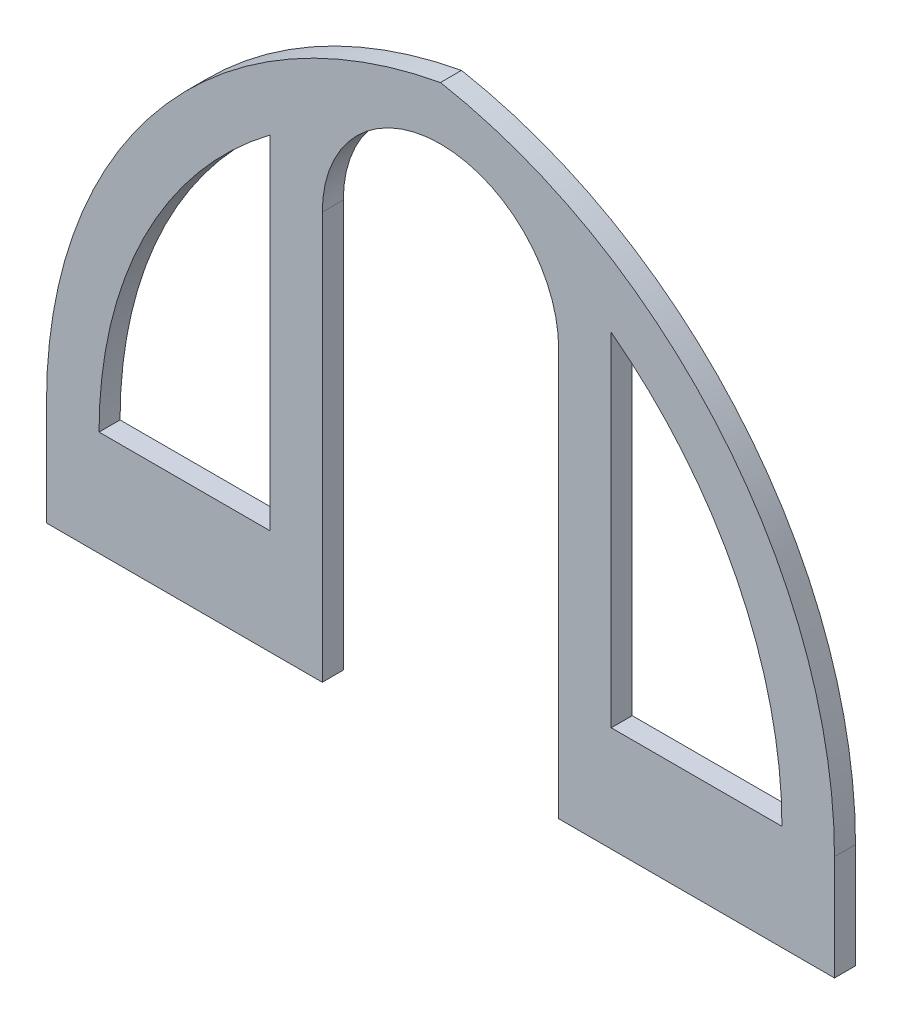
ISO-10303-21;
HEADER;
FILE_DESCRIPTION(('STEP AP214'),'2;1');
FILE_NAME('part.step','',(''),(''),'','','');
FILE_SCHEMA(('AUTOMOTIVE_DESIGN { 1 0 10303 214 1 1 1 1 }'));
ENDSEC;
DATA;
#1=APPLICATION_CONTEXT('core data for automotive mechanical design processes');
#2=APPLICATION_PROTOCOL_DEFINITION('international standard','automotive_design',2000,#1);
#3=PRODUCT_CONTEXT('',#1,'mechanical');
#4=PRODUCT('Part','Part','',(#3));
#5=PRODUCT_RELATED_PRODUCT_CATEGORY('part','',(#4));
#6=PRODUCT_DEFINITION_FORMATION('','',#4);
#7=PRODUCT_DEFINITION_CONTEXT('part definition',#1,'design');
#8=PRODUCT_DEFINITION('design','',#6,#7);
#9=PRODUCT_DEFINITION_SHAPE('','',#8);
#10=(LENGTH_UNIT() NAMED_UNIT(*) SI_UNIT(.MILLI.,.METRE.));
#11=(NAMED_UNIT(*) PLANE_ANGLE_UNIT() SI_UNIT($,.RADIAN.));
#12=(NAMED_UNIT(*) SI_UNIT($,.STERADIAN.) SOLID_ANGLE_UNIT());
#13=UNCERTAINTY_MEASURE_WITH_UNIT(LENGTH_MEASURE(1.E-05),#10,'distance_accuracy_value','');
#14=(GEOMETRIC_REPRESENTATION_CONTEXT(3) GLOBAL_UNCERTAINTY_ASSIGNED_CONTEXT((#13)) GLOBAL_UNIT_ASSIGNED_CONTEXT((#10,
#11,#12)) REPRESENTATION_CONTEXT('',''));
#15=CARTESIAN_POINT('',(0.,0.,0.));
#16=DIRECTION('',(0.,0.,1.));
#17=DIRECTION('',(1.,0.,0.));
#18=AXIS2_PLACEMENT_3D('',#15,#16,#17);
#19=CARTESIAN_POINT('',(340.484895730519,-91.3706169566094,80.));
#20=DIRECTION('',(0.,0.,-1.));
#21=DIRECTION('',(-1.,0.,0.));
#22=AXIS2_PLACEMENT_3D('',#19,#20,#21);
#23=PLANE('',#22);
#24=CARTESIAN_POINT('',(340.484895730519,-91.3706169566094,80.));
#25=DIRECTION('',(0.,0.,1.));
#26=DIRECTION('',(-1.,0.,0.));
#27=AXIS2_PLACEMENT_3D('',#24,#25,#26);
#28=CIRCLE('',#27,1633.03652149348);
#29=CARTESIAN_POINT('',(-642.55162576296,1212.64145275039,80.));
#30=VERTEX_POINT('',#29);
#31=CARTESIAN_POINT('',(-1292.55162576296,-91.3706169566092,80.));
#32=VERTEX_POINT('',#31);
#33=EDGE_CURVE('E167',#30,#32,#28,.T.);
#34=ORIENTED_EDGE('',*,*,#33,.F.);
#35=DIRECTION('',(0.,1.,0.));
#36=VECTOR('',#35,1.);
#37=CARTESIAN_POINT('',(-642.55162576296,1212.64145275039,80.));
#38=LINE('',#37,#36);
#39=CARTESIAN_POINT('',(-642.55162576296,-91.3706169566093,80.));
#40=VERTEX_POINT('',#39);
#41=EDGE_CURVE('E173',#40,#30,#38,.T.);
#42=ORIENTED_EDGE('',*,*,#41,.F.);
#43=DIRECTION('',(1.,0.,0.));
#44=VECTOR('',#43,1.);
#45=CARTESIAN_POINT('',(-1292.55162576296,-91.3706169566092,80.));
#46=LINE('',#45,#44);
#47=EDGE_CURVE('E169',#32,#40,#46,.T.);
#48=ORIENTED_EDGE('',*,*,#47,.F.);
#49=EDGE_LOOP('',(#34,#42,#48));
#50=FACE_BOUND('',#49,.T.);
#51=CARTESIAN_POINT('',(340.484895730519,-91.3706169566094,80.));
#52=DIRECTION('',(0.,0.,1.));
#53=DIRECTION('',(-1.,0.,0.));
#54=AXIS2_PLACEMENT_3D('',#51,#52,#53);
#55=CIRCLE('',#54,1833.03652149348);
#56=CARTESIAN_POINT('',(7.44837423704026,1711.15804147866,80.));
#57=VERTEX_POINT('',#56);
#58=CARTESIAN_POINT('',(-1492.55162576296,-91.3706169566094,80.));
#59=VERTEX_POINT('',#58);
#60=EDGE_CURVE('E191',#57,#59,#55,.T.);
#61=ORIENTED_EDGE('',*,*,#60,.T.);
#62=DIRECTION('',(0.,-1.,0.));
#63=VECTOR('',#62,1.);
#64=CARTESIAN_POINT('',(-1492.55162576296,-491.370616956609,80.));
#65=LINE('',#64,#63);
#66=CARTESIAN_POINT('',(-1492.55162576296,-491.370616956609,80.));
#67=VERTEX_POINT('',#66);
#68=EDGE_CURVE('E194',#59,#67,#65,.T.);
#69=ORIENTED_EDGE('',*,*,#68,.T.);
#70=DIRECTION('',(1.,0.,0.));
#71=VECTOR('',#70,1.);
#72=CARTESIAN_POINT('',(-442.55162576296,-491.370616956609,80.));
#73=LINE('',#72,#71);
#74=CARTESIAN_POINT('',(-442.55162576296,-491.370616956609,80.));
#75=VERTEX_POINT('',#74);
#76=EDGE_CURVE('E197',#67,#75,#73,.T.);
#77=ORIENTED_EDGE('',*,*,#76,.T.);
#78=DIRECTION('',(0.,1.,0.));
#79=VECTOR('',#78,1.);
#80=CARTESIAN_POINT('',(-442.55162576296,1058.62938304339,80.));
#81=LINE('',#80,#79);
#82=CARTESIAN_POINT('',(-442.55162576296,1058.62938304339,80.));
#83=VERTEX_POINT('',#82);
#84=EDGE_CURVE('E199',#75,#83,#81,.T.);
#85=ORIENTED_EDGE('',*,*,#84,.T.);
#86=CARTESIAN_POINT('',(7.44837423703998,1058.62938304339,80.));
#87=DIRECTION('',(0.,0.,-1.));
#88=DIRECTION('',(1.,0.,0.));
#89=AXIS2_PLACEMENT_3D('',#86,#87,#88);
#90=CIRCLE('',#89,450.);
#91=CARTESIAN_POINT('',(457.44837423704,1058.62938304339,80.));
#92=VERTEX_POINT('',#91);
#93=EDGE_CURVE('E201',#83,#92,#90,.T.);
#94=ORIENTED_EDGE('',*,*,#93,.T.);
#95=DIRECTION('',(0.,-1.,0.));
#96=VECTOR('',#95,1.);
#97=CARTESIAN_POINT('',(457.44837423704,1058.62938304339,80.));
#98=LINE('',#97,#96);
#99=CARTESIAN_POINT('',(457.44837423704,-491.370616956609,80.));
#100=VERTEX_POINT('',#99);
#101=EDGE_CURVE('E203',#92,#100,#98,.T.);
#102=ORIENTED_EDGE('',*,*,#101,.T.);
#103=DIRECTION('',(1.,0.,0.));
#104=VECTOR('',#103,1.);
#105=CARTESIAN_POINT('',(1507.44837423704,-491.370616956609,80.));
#106=LINE('',#105,#104);
#107=CARTESIAN_POINT('',(1507.44837423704,-491.370616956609,80.));
#108=VERTEX_POINT('',#107);
#109=EDGE_CURVE('E205',#100,#108,#106,.T.);
#110=ORIENTED_EDGE('',*,*,#109,.T.);
#111=DIRECTION('',(0.,1.,0.));
#112=VECTOR('',#111,1.);
#113=CARTESIAN_POINT('',(1507.44837423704,-491.370616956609,80.));
#114=LINE('',#113,#112);
#115=CARTESIAN_POINT('',(1507.44837423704,-91.3706169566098,80.));
#116=VERTEX_POINT('',#115);
#117=EDGE_CURVE('E207',#108,#116,#114,.T.);
#118=ORIENTED_EDGE('',*,*,#117,.T.);
#119=CARTESIAN_POINT('',(-325.588147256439,-91.3706169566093,80.));
#120=DIRECTION('',(0.,0.,1.));
#121=DIRECTION('',(1.,0.,0.));
#122=AXIS2_PLACEMENT_3D('',#119,#120,#121);
#123=CIRCLE('',#122,1833.03652149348);
#124=EDGE_CURVE('E209',#116,#57,#123,.T.);
#125=ORIENTED_EDGE('',*,*,#124,.T.);
#126=EDGE_LOOP('',(#61,#69,#77,#85,#94,#102,#110,#118,#125));
#127=FACE_BOUND('',#126,.T.);
#128=CARTESIAN_POINT('',(-325.588147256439,-91.3706169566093,80.));
#129=DIRECTION('',(0.,0.,1.));
#130=DIRECTION('',(1.,0.,0.));
#131=AXIS2_PLACEMENT_3D('',#128,#129,#130);
#132=CIRCLE('',#131,1633.03652149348);
#133=CARTESIAN_POINT('',(1307.44837423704,-91.3706169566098,80.));
#134=VERTEX_POINT('',#133);
#135=CARTESIAN_POINT('',(657.44837423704,1212.64145275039,80.));
#136=VERTEX_POINT('',#135);
#137=EDGE_CURVE('E140',#134,#136,#132,.T.);
#138=ORIENTED_EDGE('',*,*,#137,.F.);
#139=DIRECTION('',(1.,0.,0.));
#140=VECTOR('',#139,1.);
#141=CARTESIAN_POINT('',(1307.44837423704,-91.3706169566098,80.));
#142=LINE('',#141,#140);
#143=CARTESIAN_POINT('',(657.44837423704,-91.3706169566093,80.));
#144=VERTEX_POINT('',#143);
#145=EDGE_CURVE('E157',#144,#134,#142,.T.);
#146=ORIENTED_EDGE('',*,*,#145,.F.);
#147=DIRECTION('',(0.,-1.,0.));
#148=VECTOR('',#147,1.);
#149=CARTESIAN_POINT('',(657.44837423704,1212.64145275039,80.));
#150=LINE('',#149,#148);
#151=EDGE_CURVE('E148',#136,#144,#150,.T.);
#152=ORIENTED_EDGE('',*,*,#151,.F.);
#153=EDGE_LOOP('',(#138,#146,#152));
#154=FACE_BOUND('',#153,.T.);
#155=ADVANCED_FACE('F33',(#50,#127,#154),#23,.F.);
#156=CARTESIAN_POINT('',(340.484895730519,-91.3706169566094,0.));
#157=DIRECTION('',(0.,0.,-1.));
#158=DIRECTION('',(-1.,0.,0.));
#159=AXIS2_PLACEMENT_3D('',#156,#157,#158);
#160=PLANE('',#159);
#161=CARTESIAN_POINT('',(340.484895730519,-91.3706169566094,0.));
#162=DIRECTION('',(0.,0.,1.));
#163=DIRECTION('',(-1.,0.,0.));
#164=AXIS2_PLACEMENT_3D('',#161,#162,#163);
#165=CIRCLE('',#164,1833.03652149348);
#166=CARTESIAN_POINT('',(7.44837423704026,1711.15804147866,0.));
#167=VERTEX_POINT('',#166);
#168=CARTESIAN_POINT('',(-1492.55162576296,-91.3706169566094,0.));
#169=VERTEX_POINT('',#168);
#170=EDGE_CURVE('E190',#167,#169,#165,.T.);
#171=ORIENTED_EDGE('',*,*,#170,.F.);
#172=CARTESIAN_POINT('',(-325.588147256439,-91.3706169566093,0.));
#173=DIRECTION('',(0.,0.,1.));
#174=DIRECTION('',(1.,0.,0.));
#175=AXIS2_PLACEMENT_3D('',#172,#173,#174);
#176=CIRCLE('',#175,1833.03652149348);
#177=CARTESIAN_POINT('',(1507.44837423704,-91.3706169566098,0.));
#178=VERTEX_POINT('',#177);
#179=EDGE_CURVE('E195',#178,#167,#176,.T.);
#180=ORIENTED_EDGE('',*,*,#179,.F.);
#181=DIRECTION('',(0.,1.,0.));
#182=VECTOR('',#181,1.);
#183=CARTESIAN_POINT('',(1507.44837423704,-491.370616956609,0.));
#184=LINE('',#183,#182);
#185=CARTESIAN_POINT('',(1507.44837423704,-491.370616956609,0.));
#186=VERTEX_POINT('',#185);
#187=EDGE_CURVE('E226',#186,#178,#184,.T.);
#188=ORIENTED_EDGE('',*,*,#187,.F.);
#189=DIRECTION('',(1.,0.,0.));
#190=VECTOR('',#189,1.);
#191=CARTESIAN_POINT('',(1507.44837423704,-491.370616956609,0.));
#192=LINE('',#191,#190);
#193=CARTESIAN_POINT('',(457.44837423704,-491.370616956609,0.));
#194=VERTEX_POINT('',#193);
#195=EDGE_CURVE('E224',#194,#186,#192,.T.);
#196=ORIENTED_EDGE('',*,*,#195,.F.);
#197=DIRECTION('',(0.,-1.,0.));
#198=VECTOR('',#197,1.);
#199=CARTESIAN_POINT('',(457.44837423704,1058.62938304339,0.));
#200=LINE('',#199,#198);
#201=CARTESIAN_POINT('',(457.44837423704,1058.62938304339,0.));
#202=VERTEX_POINT('',#201);
#203=EDGE_CURVE('E222',#202,#194,#200,.T.);
#204=ORIENTED_EDGE('',*,*,#203,.F.);
#205=CARTESIAN_POINT('',(7.44837423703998,1058.62938304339,0.));
#206=DIRECTION('',(0.,0.,-1.));
#207=DIRECTION('',(1.,0.,0.));
#208=AXIS2_PLACEMENT_3D('',#205,#206,#207);
#209=CIRCLE('',#208,450.);
#210=CARTESIAN_POINT('',(-442.55162576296,1058.62938304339,0.));
#211=VERTEX_POINT('',#210);
#212=EDGE_CURVE('E220',#211,#202,#209,.T.);
#213=ORIENTED_EDGE('',*,*,#212,.F.);
#214=DIRECTION('',(0.,1.,0.));
#215=VECTOR('',#214,1.);
#216=CARTESIAN_POINT('',(-442.55162576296,1058.62938304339,0.));
#217=LINE('',#216,#215);
#218=CARTESIAN_POINT('',(-442.55162576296,-491.370616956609,0.));
#219=VERTEX_POINT('',#218);
#220=EDGE_CURVE('E218',#219,#211,#217,.T.);
#221=ORIENTED_EDGE('',*,*,#220,.F.);
#222=DIRECTION('',(1.,0.,0.));
#223=VECTOR('',#222,1.);
#224=CARTESIAN_POINT('',(-442.55162576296,-491.370616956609,0.));
#225=LINE('',#224,#223);
#226=CARTESIAN_POINT('',(-1492.55162576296,-491.370616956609,0.));
#227=VERTEX_POINT('',#226);
#228=EDGE_CURVE('E216',#227,#219,#225,.T.);
#229=ORIENTED_EDGE('',*,*,#228,.F.);
#230=DIRECTION('',(0.,-1.,0.));
#231=VECTOR('',#230,1.);
#232=CARTESIAN_POINT('',(-1492.55162576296,-491.370616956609,0.));
#233=LINE('',#232,#231);
#234=EDGE_CURVE('E214',#169,#227,#233,.T.);
#235=ORIENTED_EDGE('',*,*,#234,.F.);
#236=EDGE_LOOP('',(#171,#180,#188,#196,#204,#213,#221,#229,#235));
#237=FACE_BOUND('',#236,.T.);
#238=DIRECTION('',(0.,1.,0.));
#239=VECTOR('',#238,1.);
#240=CARTESIAN_POINT('',(-642.55162576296,1212.64145275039,0.));
#241=LINE('',#240,#239);
#242=CARTESIAN_POINT('',(-642.55162576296,-91.3706169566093,0.));
#243=VERTEX_POINT('',#242);
#244=CARTESIAN_POINT('',(-642.55162576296,1212.64145275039,0.));
#245=VERTEX_POINT('',#244);
#246=EDGE_CURVE('E170',#243,#245,#241,.T.);
#247=ORIENTED_EDGE('',*,*,#246,.T.);
#248=CARTESIAN_POINT('',(340.484895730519,-91.3706169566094,0.));
#249=DIRECTION('',(0.,0.,1.));
#250=DIRECTION('',(-1.,0.,0.));
#251=AXIS2_PLACEMENT_3D('',#248,#249,#250);
#252=CIRCLE('',#251,1633.03652149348);
#253=CARTESIAN_POINT('',(-1292.55162576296,-91.3706169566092,0.));
#254=VERTEX_POINT('',#253);
#255=EDGE_CURVE('E155',#245,#254,#252,.T.);
#256=ORIENTED_EDGE('',*,*,#255,.T.);
#257=DIRECTION('',(1.,0.,0.));
#258=VECTOR('',#257,1.);
#259=CARTESIAN_POINT('',(-1292.55162576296,-91.3706169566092,0.));
#260=LINE('',#259,#258);
#261=EDGE_CURVE('E178',#254,#243,#260,.T.);
#262=ORIENTED_EDGE('',*,*,#261,.T.);
#263=EDGE_LOOP('',(#247,#256,#262));
#264=FACE_BOUND('',#263,.T.);
#265=DIRECTION('',(1.,0.,0.));
#266=VECTOR('',#265,1.);
#267=CARTESIAN_POINT('',(1307.44837423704,-91.3706169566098,0.));
#268=LINE('',#267,#266);
#269=CARTESIAN_POINT('',(657.44837423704,-91.3706169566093,0.));
#270=VERTEX_POINT('',#269);
#271=CARTESIAN_POINT('',(1307.44837423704,-91.3706169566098,0.));
#272=VERTEX_POINT('',#271);
#273=EDGE_CURVE('E149',#270,#272,#268,.T.);
#274=ORIENTED_EDGE('',*,*,#273,.T.);
#275=CARTESIAN_POINT('',(-325.588147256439,-91.3706169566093,0.));
#276=DIRECTION('',(0.,0.,1.));
#277=DIRECTION('',(1.,0.,0.));
#278=AXIS2_PLACEMENT_3D('',#275,#276,#277);
#279=CIRCLE('',#278,1633.03652149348);
#280=CARTESIAN_POINT('',(657.44837423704,1212.64145275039,0.));
#281=VERTEX_POINT('',#280);
#282=EDGE_CURVE('E56',#272,#281,#279,.T.);
#283=ORIENTED_EDGE('',*,*,#282,.T.);
#284=DIRECTION('',(0.,-1.,0.));
#285=VECTOR('',#284,1.);
#286=CARTESIAN_POINT('',(657.44837423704,1212.64145275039,0.));
#287=LINE('',#286,#285);
#288=EDGE_CURVE('E154',#281,#270,#287,.T.);
#289=ORIENTED_EDGE('',*,*,#288,.T.);
#290=EDGE_LOOP('',(#274,#283,#289));
#291=FACE_BOUND('',#290,.T.);
#292=ADVANCED_FACE('F259',(#237,#264,#291),#160,.T.);
#293=CARTESIAN_POINT('',(340.484895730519,-91.3706169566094,80.));
#294=DIRECTION('',(0.,0.,-1.));
#295=DIRECTION('',(-1.,0.,0.));
#296=AXIS2_PLACEMENT_3D('',#293,#294,#295);
#297=CYLINDRICAL_SURFACE('',#296,1833.03652149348);
#298=ORIENTED_EDGE('',*,*,#170,.T.);
#299=DIRECTION('',(0.,0.,-1.));
#300=VECTOR('',#299,1.);
#301=CARTESIAN_POINT('',(-1492.55162576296,-91.3706169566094,80.));
#302=LINE('',#301,#300);
#303=EDGE_CURVE('E11',#59,#169,#302,.T.);
#304=ORIENTED_EDGE('',*,*,#303,.F.);
#305=ORIENTED_EDGE('',*,*,#60,.F.);
#306=DIRECTION('',(0.,0.,-1.));
#307=VECTOR('',#306,1.);
#308=CARTESIAN_POINT('',(7.44837423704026,1711.15804147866,80.));
#309=LINE('',#308,#307);
#310=EDGE_CURVE('E211',#57,#167,#309,.T.);
#311=ORIENTED_EDGE('',*,*,#310,.T.);
#312=EDGE_LOOP('',(#298,#304,#305,#311));
#313=FACE_BOUND('',#312,.T.);
#314=ADVANCED_FACE('F35',(#313),#297,.T.);
#315=CARTESIAN_POINT('',(-1492.55162576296,-491.370616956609,80.));
#316=DIRECTION('',(1.,0.,0.));
#317=DIRECTION('',(0.,0.,-1.));
#318=AXIS2_PLACEMENT_3D('',#315,#316,#317);
#319=PLANE('',#318);
#320=ORIENTED_EDGE('',*,*,#234,.T.);
#321=DIRECTION('',(0.,0.,-1.));
#322=VECTOR('',#321,1.);
#323=CARTESIAN_POINT('',(-1492.55162576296,-491.370616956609,80.));
#324=LINE('',#323,#322);
#325=EDGE_CURVE('E41',#67,#227,#324,.T.);
#326=ORIENTED_EDGE('',*,*,#325,.F.);
#327=ORIENTED_EDGE('',*,*,#68,.F.);
#328=ORIENTED_EDGE('',*,*,#303,.T.);
#329=EDGE_LOOP('',(#320,#326,#327,#328));
#330=FACE_BOUND('',#329,.T.);
#331=ADVANCED_FACE('F276',(#330),#319,.F.);
#332=CARTESIAN_POINT('',(-442.55162576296,-491.370616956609,80.));
#333=DIRECTION('',(0.,1.,0.));
#334=DIRECTION('',(-1.,0.,0.));
#335=AXIS2_PLACEMENT_3D('',#332,#333,#334);
#336=PLANE('',#335);
#337=ORIENTED_EDGE('',*,*,#228,.T.);
#338=DIRECTION('',(0.,0.,-1.));
#339=VECTOR('',#338,1.);
#340=CARTESIAN_POINT('',(-442.55162576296,-491.370616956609,80.));
#341=LINE('',#340,#339);
#342=EDGE_CURVE('E246',#75,#219,#341,.T.);
#343=ORIENTED_EDGE('',*,*,#342,.F.);
#344=ORIENTED_EDGE('',*,*,#76,.F.);
#345=ORIENTED_EDGE('',*,*,#325,.T.);
#346=EDGE_LOOP('',(#337,#343,#344,#345));
#347=FACE_BOUND('',#346,.T.);
#348=ADVANCED_FACE('F253',(#347),#336,.F.);
#349=CARTESIAN_POINT('',(-442.55162576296,1058.62938304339,80.));
#350=DIRECTION('',(-1.,0.,0.));
#351=DIRECTION('',(0.,-1.,0.));
#352=AXIS2_PLACEMENT_3D('',#349,#350,#351);
#353=PLANE('',#352);
#354=ORIENTED_EDGE('',*,*,#220,.T.);
#355=DIRECTION('',(0.,0.,-1.));
#356=VECTOR('',#355,1.);
#357=CARTESIAN_POINT('',(-442.55162576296,1058.62938304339,80.));
#358=LINE('',#357,#356);
#359=EDGE_CURVE('E243',#83,#211,#358,.T.);
#360=ORIENTED_EDGE('',*,*,#359,.F.);
#361=ORIENTED_EDGE('',*,*,#84,.F.);
#362=ORIENTED_EDGE('',*,*,#342,.T.);
#363=EDGE_LOOP('',(#354,#360,#361,#362));
#364=FACE_BOUND('',#363,.T.);
#365=ADVANCED_FACE('F265',(#364),#353,.F.);
#366=CARTESIAN_POINT('',(7.44837423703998,1058.62938304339,80.));
#367=DIRECTION('',(0.,0.,-1.));
#368=DIRECTION('',(-1.,0.,0.));
#369=AXIS2_PLACEMENT_3D('',#366,#367,#368);
#370=CYLINDRICAL_SURFACE('',#369,450.);
#371=ORIENTED_EDGE('',*,*,#212,.T.);
#372=DIRECTION('',(0.,0.,-1.));
#373=VECTOR('',#372,1.);
#374=CARTESIAN_POINT('',(457.44837423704,1058.62938304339,80.));
#375=LINE('',#374,#373);
#376=EDGE_CURVE('E240',#92,#202,#375,.T.);
#377=ORIENTED_EDGE('',*,*,#376,.F.);
#378=ORIENTED_EDGE('',*,*,#93,.F.);
#379=ORIENTED_EDGE('',*,*,#359,.T.);
#380=EDGE_LOOP('',(#371,#377,#378,#379));
#381=FACE_BOUND('',#380,.T.);
#382=ADVANCED_FACE('F269',(#381),#370,.F.);
#383=CARTESIAN_POINT('',(457.44837423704,1058.62938304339,80.));
#384=DIRECTION('',(1.,0.,0.));
#385=DIRECTION('',(0.,0.,-1.));
#386=AXIS2_PLACEMENT_3D('',#383,#384,#385);
#387=PLANE('',#386);
#388=ORIENTED_EDGE('',*,*,#203,.T.);
#389=DIRECTION('',(0.,0.,-1.));
#390=VECTOR('',#389,1.);
#391=CARTESIAN_POINT('',(457.44837423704,-491.370616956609,80.));
#392=LINE('',#391,#390);
#393=EDGE_CURVE('E237',#100,#194,#392,.T.);
#394=ORIENTED_EDGE('',*,*,#393,.F.);
#395=ORIENTED_EDGE('',*,*,#101,.F.);
#396=ORIENTED_EDGE('',*,*,#376,.T.);
#397=EDGE_LOOP('',(#388,#394,#395,#396));
#398=FACE_BOUND('',#397,.T.);
#399=ADVANCED_FACE('F294',(#398),#387,.F.);
#400=CARTESIAN_POINT('',(1507.44837423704,-491.370616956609,80.));
#401=DIRECTION('',(0.,1.,0.));
#402=DIRECTION('',(-1.,0.,0.));
#403=AXIS2_PLACEMENT_3D('',#400,#401,#402);
#404=PLANE('',#403);
#405=ORIENTED_EDGE('',*,*,#195,.T.);
#406=DIRECTION('',(0.,0.,-1.));
#407=VECTOR('',#406,1.);
#408=CARTESIAN_POINT('',(1507.44837423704,-491.370616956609,80.));
#409=LINE('',#408,#407);
#410=EDGE_CURVE('E234',#108,#186,#409,.T.);
#411=ORIENTED_EDGE('',*,*,#410,.F.);
#412=ORIENTED_EDGE('',*,*,#109,.F.);
#413=ORIENTED_EDGE('',*,*,#393,.T.);
#414=EDGE_LOOP('',(#405,#411,#412,#413));
#415=FACE_BOUND('',#414,.T.);
#416=ADVANCED_FACE('F292',(#415),#404,.F.);
#417=CARTESIAN_POINT('',(1507.44837423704,-491.370616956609,80.));
#418=DIRECTION('',(-1.,0.,0.));
#419=DIRECTION('',(0.,0.,1.));
#420=AXIS2_PLACEMENT_3D('',#417,#418,#419);
#421=PLANE('',#420);
#422=ORIENTED_EDGE('',*,*,#187,.T.);
#423=DIRECTION('',(0.,0.,-1.));
#424=VECTOR('',#423,1.);
#425=CARTESIAN_POINT('',(1507.44837423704,-91.3706169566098,80.));
#426=LINE('',#425,#424);
#427=EDGE_CURVE('E231',#116,#178,#426,.T.);
#428=ORIENTED_EDGE('',*,*,#427,.F.);
#429=ORIENTED_EDGE('',*,*,#117,.F.);
#430=ORIENTED_EDGE('',*,*,#410,.T.);
#431=EDGE_LOOP('',(#422,#428,#429,#430));
#432=FACE_BOUND('',#431,.T.);
#433=ADVANCED_FACE('F288',(#432),#421,.F.);
#434=CARTESIAN_POINT('',(-325.588147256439,-91.3706169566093,80.));
#435=DIRECTION('',(0.,0.,-1.));
#436=DIRECTION('',(-1.,0.,0.));
#437=AXIS2_PLACEMENT_3D('',#434,#435,#436);
#438=CYLINDRICAL_SURFACE('',#437,1833.03652149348);
#439=ORIENTED_EDGE('',*,*,#179,.T.);
#440=ORIENTED_EDGE('',*,*,#310,.F.);
#441=ORIENTED_EDGE('',*,*,#124,.F.);
#442=ORIENTED_EDGE('',*,*,#427,.T.);
#443=EDGE_LOOP('',(#439,#440,#441,#442));
#444=FACE_BOUND('',#443,.T.);
#445=ADVANCED_FACE('F283',(#444),#438,.T.);
#446=CARTESIAN_POINT('',(340.484895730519,-91.3706169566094,80.));
#447=DIRECTION('',(0.,0.,-1.));
#448=DIRECTION('',(-1.,0.,0.));
#449=AXIS2_PLACEMENT_3D('',#446,#447,#448);
#450=CYLINDRICAL_SURFACE('',#449,1633.03652149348);
#451=ORIENTED_EDGE('',*,*,#255,.F.);
#452=DIRECTION('',(0.,0.,-1.));
#453=VECTOR('',#452,1.);
#454=CARTESIAN_POINT('',(-642.55162576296,1212.64145275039,80.));
#455=LINE('',#454,#453);
#456=EDGE_CURVE('E175',#30,#245,#455,.T.);
#457=ORIENTED_EDGE('',*,*,#456,.F.);
#458=ORIENTED_EDGE('',*,*,#33,.T.);
#459=DIRECTION('',(0.,0.,-1.));
#460=VECTOR('',#459,1.);
#461=CARTESIAN_POINT('',(-1292.55162576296,-91.3706169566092,80.));
#462=LINE('',#461,#460);
#463=EDGE_CURVE('E187',#32,#254,#462,.T.);
#464=ORIENTED_EDGE('',*,*,#463,.T.);
#465=EDGE_LOOP('',(#451,#457,#458,#464));
#466=FACE_BOUND('',#465,.T.);
#467=ADVANCED_FACE('F312',(#466),#450,.F.);
#468=CARTESIAN_POINT('',(-1292.55162576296,-91.3706169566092,80.));
#469=DIRECTION('',(0.,1.,0.));
#470=DIRECTION('',(-1.,0.,0.));
#471=AXIS2_PLACEMENT_3D('',#468,#469,#470);
#472=PLANE('',#471);
#473=ORIENTED_EDGE('',*,*,#261,.F.);
#474=ORIENTED_EDGE('',*,*,#463,.F.);
#475=ORIENTED_EDGE('',*,*,#47,.T.);
#476=DIRECTION('',(0.,0.,-1.));
#477=VECTOR('',#476,1.);
#478=CARTESIAN_POINT('',(-642.55162576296,-91.3706169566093,80.));
#479=LINE('',#478,#477);
#480=EDGE_CURVE('E185',#40,#243,#479,.T.);
#481=ORIENTED_EDGE('',*,*,#480,.T.);
#482=EDGE_LOOP('',(#473,#474,#475,#481));
#483=FACE_BOUND('',#482,.T.);
#484=ADVANCED_FACE('F332',(#483),#472,.T.);
#485=CARTESIAN_POINT('',(-642.55162576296,1212.64145275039,80.));
#486=DIRECTION('',(-1.,0.,0.));
#487=DIRECTION('',(0.,-1.,0.));
#488=AXIS2_PLACEMENT_3D('',#485,#486,#487);
#489=PLANE('',#488);
#490=ORIENTED_EDGE('',*,*,#246,.F.);
#491=ORIENTED_EDGE('',*,*,#480,.F.);
#492=ORIENTED_EDGE('',*,*,#41,.T.);
#493=ORIENTED_EDGE('',*,*,#456,.T.);
#494=EDGE_LOOP('',(#490,#491,#492,#493));
#495=FACE_BOUND('',#494,.T.);
#496=ADVANCED_FACE('F339',(#495),#489,.T.);
#497=CARTESIAN_POINT('',(-325.588147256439,-91.3706169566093,80.));
#498=DIRECTION('',(0.,0.,-1.));
#499=DIRECTION('',(-1.,0.,0.));
#500=AXIS2_PLACEMENT_3D('',#497,#498,#499);
#501=CYLINDRICAL_SURFACE('',#500,1633.03652149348);
#502=ORIENTED_EDGE('',*,*,#282,.F.);
#503=DIRECTION('',(0.,0.,-1.));
#504=VECTOR('',#503,1.);
#505=CARTESIAN_POINT('',(1307.44837423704,-91.3706169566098,80.));
#506=LINE('',#505,#504);
#507=EDGE_CURVE('E144',#134,#272,#506,.T.);
#508=ORIENTED_EDGE('',*,*,#507,.F.);
#509=ORIENTED_EDGE('',*,*,#137,.T.);
#510=DIRECTION('',(0.,0.,-1.));
#511=VECTOR('',#510,1.);
#512=CARTESIAN_POINT('',(657.44837423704,1212.64145275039,80.));
#513=LINE('',#512,#511);
#514=EDGE_CURVE('E143',#136,#281,#513,.T.);
#515=ORIENTED_EDGE('',*,*,#514,.T.);
#516=EDGE_LOOP('',(#502,#508,#509,#515));
#517=FACE_BOUND('',#516,.T.);
#518=ADVANCED_FACE('F142',(#517),#501,.F.);
#519=CARTESIAN_POINT('',(657.44837423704,1212.64145275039,80.));
#520=DIRECTION('',(1.,0.,0.));
#521=DIRECTION('',(0.,0.,-1.));
#522=AXIS2_PLACEMENT_3D('',#519,#520,#521);
#523=PLANE('',#522);
#524=ORIENTED_EDGE('',*,*,#288,.F.);
#525=ORIENTED_EDGE('',*,*,#514,.F.);
#526=ORIENTED_EDGE('',*,*,#151,.T.);
#527=DIRECTION('',(0.,0.,-1.));
#528=VECTOR('',#527,1.);
#529=CARTESIAN_POINT('',(657.44837423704,-91.3706169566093,80.));
#530=LINE('',#529,#528);
#531=EDGE_CURVE('E48',#144,#270,#530,.T.);
#532=ORIENTED_EDGE('',*,*,#531,.T.);
#533=EDGE_LOOP('',(#524,#525,#526,#532));
#534=FACE_BOUND('',#533,.T.);
#535=ADVANCED_FACE('F152',(#534),#523,.T.);
#536=CARTESIAN_POINT('',(1307.44837423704,-91.3706169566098,80.));
#537=DIRECTION('',(0.,1.,0.));
#538=DIRECTION('',(-1.,0.,0.));
#539=AXIS2_PLACEMENT_3D('',#536,#537,#538);
#540=PLANE('',#539);
#541=ORIENTED_EDGE('',*,*,#273,.F.);
#542=ORIENTED_EDGE('',*,*,#531,.F.);
#543=ORIENTED_EDGE('',*,*,#145,.T.);
#544=ORIENTED_EDGE('',*,*,#507,.T.);
#545=EDGE_LOOP('',(#541,#542,#543,#544));
#546=FACE_BOUND('',#545,.T.);
#547=ADVANCED_FACE('F359',(#546),#540,.T.);
#548=CLOSED_SHELL('',(#155,#292,#314,#331,#348,#365,#382,#399,#416,#433,#445,#467,#484,#496,
#518,#535,#547));
#549=MANIFOLD_SOLID_BREP('B2',#548);
#550=ADVANCED_BREP_SHAPE_REPRESENTATION('',(#18,#549),#14);
#551=SHAPE_DEFINITION_REPRESENTATION(#9,#550);
ENDSEC;
END-ISO-10303-21;
